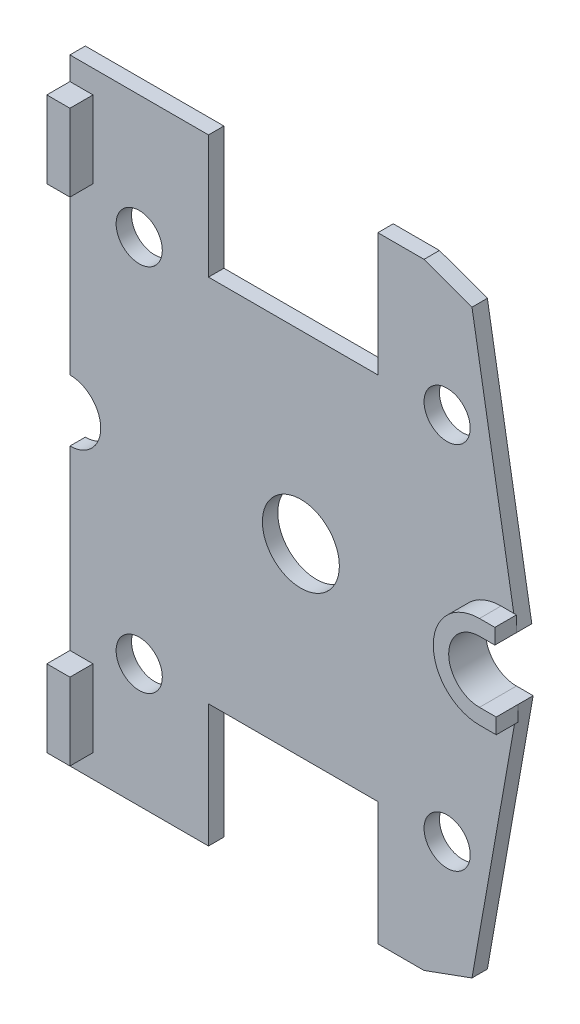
from build123d import *

# Parameters (mm, degrees)
ESQUISSE2_R                     = 2.5
BASE_EXTRUSION_DEPTH            = 1
ESQUISSE3_R                     = 1.5
ENL_V_MAT_EXTRU_1_DEPTH         = 50.468386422
R_P_TITION_LIN_AIRE1_COUNT      = 2
R_P_TITION_LIN_AIRE1_PITCH      = 24
R_P_TITION_LIN_AIRE1_COUNT_DIR2 = 2
R_P_TITION_LIN_AIRE1_PITCH_DIR2 = 20
ESQUISSE4_W                     = 1.5
ESQUISSE4_H                     = 5
BOSS_EXTRU_1_DEPTH              = 1.5
BOSS_EXTRU_MINCE1_DEPTH         = 1.4


with BuildPart() as part:
    # Esquisse2 → Base-Extrusion (new body)
    with BuildSketch(Plane.XY):
        with BuildLine():
            Line((20, 0), (23, 0))
            Line((23, 0), (26.11413616, 1.133452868))
            Line((26.11413616, 1.133452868), (29.08816349, 18))
            Line((29.08816349, 18), (28, 18))
            ThreePointArc((28, 18), (26, 20), (28, 22))
            Line((28, 22), (29, 22))
            Line((29, 22), (26.11413616, 38.866547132))
            Line((26.11413616, 38.866547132), (23, 40))
            Line((23, 40), (20, 40))
            Line((20, 40), (20, 32))
            Line((20, 32), (9, 32))
            Line((9, 32), (9, 40))
            Line((9, 40), (0, 40))
            Line((0, 40), (0, 22))
            ThreePointArc((0, 22), (2, 20), (0, 18))
            Line((0, 18), (0, 0))
            Line((0, 0), (9, 0))
            Line((9, 0), (9, 8))
            Line((9, 8), (20, 8))
            Line((20, 8), (20, 0))
        make_face()
        with Locations((15, 20)):
            Circle(ESQUISSE2_R, mode=Mode.SUBTRACT)
    extrude(amount=BASE_EXTRUSION_DEPTH)

    # Esquisse3 → Enl_v. mat.-Extru.1 (cut, through all)
    with BuildSketch(Plane.XY.offset(1)):
        with Locations((4.5, 8)):
            Circle(ESQUISSE3_R)
    enl_v_mat_extru_1 = extrude(amount=-ENL_V_MAT_EXTRU_1_DEPTH, mode=Mode.SUBTRACT)

    # R_p_tition lin_aire1: Enl_v. mat.-Extru.1 2 × 2
    with Locations(*[(j * R_P_TITION_LIN_AIRE1_PITCH_DIR2, i * R_P_TITION_LIN_AIRE1_PITCH, 0) for i in range(R_P_TITION_LIN_AIRE1_COUNT) for j in range(R_P_TITION_LIN_AIRE1_COUNT_DIR2) if (i, j) != (0, 0)]):
        add(enl_v_mat_extru_1, mode=Mode.SUBTRACT)

    # Esquisse4 → Boss.-Extru.1 (add)
    with BuildSketch(Plane.XY.offset(1)):
        with Locations((0.75, 36)):
            Rectangle(ESQUISSE4_W, ESQUISSE4_H)
        with Locations((0.75, 4)):
            Rectangle(ESQUISSE4_W, ESQUISSE4_H)
    extrude(amount=BOSS_EXTRU_1_DEPTH)

    # Esquisse5 → Boss.-Extru.-Mince1 (add)
    with BuildSketch(Plane.XY.offset(1)):
        with BuildLine():
            Line((29.08816349, 18), (28, 18))
            ThreePointArc((28, 18), (26, 20), (28, 22))
            Line((28, 22), (29, 22))
            Line((29, 22), (29, 23))
            Line((29, 23), (28, 23))
            ThreePointArc((28, 23), (25, 20), (28, 17))
            Line((28, 17), (29.08816349, 17))
            Line((29.08816349, 17), (29.08816349, 18))
        make_face()
    extrude(amount=BOSS_EXTRU_MINCE1_DEPTH)


solid = part.part
